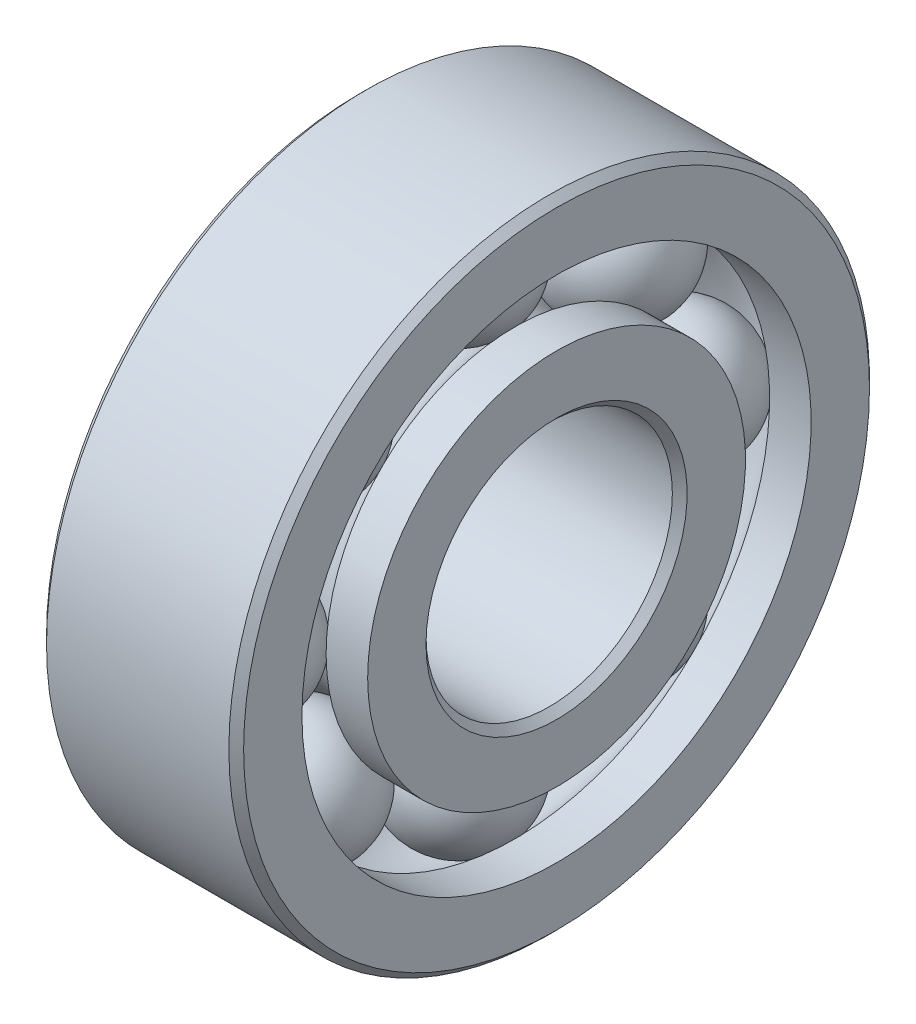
ISO-10303-21;
HEADER;
FILE_DESCRIPTION(('STEP AP214'),'2;1');
FILE_NAME('part.step','',(''),(''),'','','');
FILE_SCHEMA(('AUTOMOTIVE_DESIGN { 1 0 10303 214 1 1 1 1 }'));
ENDSEC;
DATA;
#1=APPLICATION_CONTEXT('core data for automotive mechanical design processes');
#2=APPLICATION_PROTOCOL_DEFINITION('international standard','automotive_design',2000,#1);
#3=PRODUCT_CONTEXT('',#1,'mechanical');
#4=PRODUCT('Part','Part','',(#3));
#5=PRODUCT_RELATED_PRODUCT_CATEGORY('part','',(#4));
#6=PRODUCT_DEFINITION_FORMATION('','',#4);
#7=PRODUCT_DEFINITION_CONTEXT('part definition',#1,'design');
#8=PRODUCT_DEFINITION('design','',#6,#7);
#9=PRODUCT_DEFINITION_SHAPE('','',#8);
#10=(LENGTH_UNIT() NAMED_UNIT(*) SI_UNIT(.MILLI.,.METRE.));
#11=(NAMED_UNIT(*) PLANE_ANGLE_UNIT() SI_UNIT($,.RADIAN.));
#12=(NAMED_UNIT(*) SI_UNIT($,.STERADIAN.) SOLID_ANGLE_UNIT());
#13=UNCERTAINTY_MEASURE_WITH_UNIT(LENGTH_MEASURE(1.E-05),#10,'distance_accuracy_value','');
#14=(GEOMETRIC_REPRESENTATION_CONTEXT(3) GLOBAL_UNCERTAINTY_ASSIGNED_CONTEXT((#13)) GLOBAL_UNIT_ASSIGNED_CONTEXT((#10,
#11,#12)) REPRESENTATION_CONTEXT('',''));
#15=CARTESIAN_POINT('',(0.,0.,0.));
#16=DIRECTION('',(0.,0.,1.));
#17=DIRECTION('',(1.,0.,0.));
#18=AXIS2_PLACEMENT_3D('',#15,#16,#17);
#19=CARTESIAN_POINT('',(0.,6.363961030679,-6.36396103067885));
#20=DIRECTION('',(-1.,0.,0.));
#21=DIRECTION('',(0.,0.707106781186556,-0.707106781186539));
#22=AXIS2_PLACEMENT_3D('',#19,#20,#21);
#23=SPHERICAL_SURFACE('',#22,2.67);
#24=CARTESIAN_POINT('',(-2.67,6.363961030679,-6.36396103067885));
#25=VERTEX_POINT('',#24);
#26=VERTEX_LOOP('',#25);
#27=FACE_BOUND('',#26,.T.);
#28=ADVANCED_FACE('F42',(#27),#23,.T.);
#29=CLOSED_SHELL('',(#28));
#30=MANIFOLD_SOLID_BREP('B2',#29);
#31=CARTESIAN_POINT('',(0.,0.,-9.));
#32=DIRECTION('',(-1.,0.,0.));
#33=DIRECTION('',(0.,0.,-1.));
#34=AXIS2_PLACEMENT_3D('',#31,#32,#33);
#35=SPHERICAL_SURFACE('',#34,2.67);
#36=CARTESIAN_POINT('',(-2.67,0.,-9.));
#37=VERTEX_POINT('',#36);
#38=VERTEX_LOOP('',#37);
#39=FACE_BOUND('',#38,.T.);
#40=ADVANCED_FACE('F63',(#39),#35,.T.);
#41=CLOSED_SHELL('',(#40));
#42=MANIFOLD_SOLID_BREP('B7',#41);
#43=CARTESIAN_POINT('',(0.,-6.36396103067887,-6.36396103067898));
#44=DIRECTION('',(-1.,0.,0.));
#45=DIRECTION('',(0.,-0.707106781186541,-0.707106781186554));
#46=AXIS2_PLACEMENT_3D('',#43,#44,#45);
#47=SPHERICAL_SURFACE('',#46,2.67);
#48=CARTESIAN_POINT('',(-2.67,-6.36396103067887,-6.36396103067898));
#49=VERTEX_POINT('',#48);
#50=VERTEX_LOOP('',#49);
#51=FACE_BOUND('',#50,.T.);
#52=ADVANCED_FACE('F81',(#51),#47,.T.);
#53=CLOSED_SHELL('',(#52));
#54=MANIFOLD_SOLID_BREP('B38',#53);
#55=CARTESIAN_POINT('',(0.,-9.,0.));
#56=DIRECTION('',(-1.,0.,0.));
#57=DIRECTION('',(0.,-1.,0.));
#58=AXIS2_PLACEMENT_3D('',#55,#56,#57);
#59=SPHERICAL_SURFACE('',#58,2.67);
#60=CARTESIAN_POINT('',(-2.67,-9.,0.));
#61=VERTEX_POINT('',#60);
#62=VERTEX_LOOP('',#61);
#63=FACE_BOUND('',#62,.T.);
#64=ADVANCED_FACE('F99',(#63),#59,.T.);
#65=CLOSED_SHELL('',(#64));
#66=MANIFOLD_SOLID_BREP('B59',#65);
#67=CARTESIAN_POINT('',(0.,-6.36396103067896,6.36396103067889));
#68=DIRECTION('',(-1.,0.,0.));
#69=DIRECTION('',(0.,-0.707106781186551,0.707106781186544));
#70=AXIS2_PLACEMENT_3D('',#67,#68,#69);
#71=SPHERICAL_SURFACE('',#70,2.67);
#72=CARTESIAN_POINT('',(-2.67,-6.36396103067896,6.36396103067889));
#73=VERTEX_POINT('',#72);
#74=VERTEX_LOOP('',#73);
#75=FACE_BOUND('',#74,.T.);
#76=ADVANCED_FACE('F117',(#75),#71,.T.);
#77=CLOSED_SHELL('',(#76));
#78=MANIFOLD_SOLID_BREP('B77',#77);
#79=CARTESIAN_POINT('',(0.,0.,9.));
#80=DIRECTION('',(-1.,0.,0.));
#81=DIRECTION('',(0.,0.,1.));
#82=AXIS2_PLACEMENT_3D('',#79,#80,#81);
#83=SPHERICAL_SURFACE('',#82,2.67);
#84=CARTESIAN_POINT('',(-2.67,0.,9.));
#85=VERTEX_POINT('',#84);
#86=VERTEX_LOOP('',#85);
#87=FACE_BOUND('',#86,.T.);
#88=ADVANCED_FACE('F135',(#87),#83,.T.);
#89=CLOSED_SHELL('',(#88));
#90=MANIFOLD_SOLID_BREP('B95',#89);
#91=CARTESIAN_POINT('',(0.,6.36396103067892,6.36396103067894));
#92=DIRECTION('',(-1.,0.,0.));
#93=DIRECTION('',(0.,0.707106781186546,0.707106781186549));
#94=AXIS2_PLACEMENT_3D('',#91,#92,#93);
#95=SPHERICAL_SURFACE('',#94,2.67);
#96=CARTESIAN_POINT('',(-2.67,6.36396103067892,6.36396103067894));
#97=VERTEX_POINT('',#96);
#98=VERTEX_LOOP('',#97);
#99=FACE_BOUND('',#98,.T.);
#100=ADVANCED_FACE('F153',(#99),#95,.T.);
#101=CLOSED_SHELL('',(#100));
#102=MANIFOLD_SOLID_BREP('B113',#101);
#103=CARTESIAN_POINT('',(0.,9.,0.));
#104=DIRECTION('',(-1.,0.,0.));
#105=DIRECTION('',(0.,1.,0.));
#106=AXIS2_PLACEMENT_3D('',#103,#104,#105);
#107=SPHERICAL_SURFACE('',#106,2.67);
#108=CARTESIAN_POINT('',(-2.67,9.,0.));
#109=VERTEX_POINT('',#108);
#110=VERTEX_LOOP('',#109);
#111=FACE_BOUND('',#110,.T.);
#112=ADVANCED_FACE('F173',(#111),#107,.T.);
#113=CLOSED_SHELL('',(#112));
#114=MANIFOLD_SOLID_BREP('B131',#113);
#115=CARTESIAN_POINT('',(-4.,10.3333333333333,0.));
#116=DIRECTION('',(1.,0.,0.));
#117=DIRECTION('',(0.,0.,-1.));
#118=AXIS2_PLACEMENT_3D('',#115,#116,#117);
#119=PLANE('',#118);
#120=CARTESIAN_POINT('',(-4.,0.,0.));
#121=DIRECTION('',(1.,0.,0.));
#122=DIRECTION('',(0.,0.,-1.));
#123=AXIS2_PLACEMENT_3D('',#120,#121,#122);
#124=CIRCLE('',#123,12.7);
#125=CARTESIAN_POINT('',(-4.,0.,-12.7));
#126=VERTEX_POINT('',#125);
#127=EDGE_CURVE('E172',#126,#126,#124,.F.);
#128=ORIENTED_EDGE('',*,*,#127,.T.);
#129=EDGE_LOOP('',(#128));
#130=FACE_BOUND('',#129,.T.);
#131=CARTESIAN_POINT('',(-4.,0.,0.));
#132=DIRECTION('',(-1.,0.,0.));
#133=DIRECTION('',(0.,0.,1.));
#134=AXIS2_PLACEMENT_3D('',#131,#132,#133);
#135=CIRCLE('',#134,10.3333333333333);
#136=CARTESIAN_POINT('',(-4.,0.,10.3333333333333));
#137=VERTEX_POINT('',#136);
#138=EDGE_CURVE('E212',#137,#137,#135,.T.);
#139=ORIENTED_EDGE('',*,*,#138,.F.);
#140=EDGE_LOOP('',(#139));
#141=FACE_BOUND('',#140,.T.);
#142=ADVANCED_FACE('F192',(#130,#141),#119,.F.);
#143=CARTESIAN_POINT('',(-4.,0.,0.));
#144=DIRECTION('',(-1.,0.,0.));
#145=DIRECTION('',(0.,0.,1.));
#146=AXIS2_PLACEMENT_3D('',#143,#144,#145);
#147=CYLINDRICAL_SURFACE('',#146,10.3333333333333);
#148=CARTESIAN_POINT('',(-2.31324927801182,0.,0.));
#149=DIRECTION('',(-1.,0.,0.));
#150=DIRECTION('',(0.,0.,1.));
#151=AXIS2_PLACEMENT_3D('',#148,#149,#150);
#152=CIRCLE('',#151,10.3333333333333);
#153=CARTESIAN_POINT('',(-2.31324927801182,0.,10.3333333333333));
#154=VERTEX_POINT('',#153);
#155=EDGE_CURVE('E215',#154,#154,#152,.T.);
#156=ORIENTED_EDGE('',*,*,#155,.F.);
#157=EDGE_LOOP('',(#156));
#158=FACE_BOUND('',#157,.T.);
#159=ORIENTED_EDGE('',*,*,#138,.T.);
#160=EDGE_LOOP('',(#159));
#161=FACE_BOUND('',#160,.T.);
#162=ADVANCED_FACE('F236',(#158,#161),#147,.F.);
#163=CARTESIAN_POINT('',(0.,0.,0.));
#164=DIRECTION('',(-1.,0.,0.));
#165=DIRECTION('',(0.,0.,1.));
#166=AXIS2_PLACEMENT_3D('',#163,#164,#165);
#167=TOROIDAL_SURFACE('',#166,9.,2.67);
#168=CARTESIAN_POINT('',(2.31324927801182,0.,0.));
#169=DIRECTION('',(-1.,0.,0.));
#170=DIRECTION('',(0.,0.,1.));
#171=AXIS2_PLACEMENT_3D('',#168,#169,#170);
#172=CIRCLE('',#171,10.3333333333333);
#173=CARTESIAN_POINT('',(2.31324927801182,0.,10.3333333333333));
#174=VERTEX_POINT('',#173);
#175=EDGE_CURVE('E218',#174,#174,#172,.T.);
#176=ORIENTED_EDGE('',*,*,#175,.F.);
#177=EDGE_LOOP('',(#176));
#178=FACE_BOUND('',#177,.T.);
#179=ORIENTED_EDGE('',*,*,#155,.T.);
#180=EDGE_LOOP('',(#179));
#181=FACE_BOUND('',#180,.T.);
#182=ADVANCED_FACE('F230',(#178,#181),#167,.F.);
#183=CARTESIAN_POINT('',(-4.,0.,0.));
#184=DIRECTION('',(-1.,0.,0.));
#185=DIRECTION('',(0.,0.,1.));
#186=AXIS2_PLACEMENT_3D('',#183,#184,#185);
#187=CYLINDRICAL_SURFACE('',#186,10.3333333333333);
#188=CARTESIAN_POINT('',(4.,0.,0.));
#189=DIRECTION('',(-1.,0.,0.));
#190=DIRECTION('',(0.,0.,1.));
#191=AXIS2_PLACEMENT_3D('',#188,#189,#190);
#192=CIRCLE('',#191,10.3333333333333);
#193=CARTESIAN_POINT('',(4.,0.,10.3333333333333));
#194=VERTEX_POINT('',#193);
#195=EDGE_CURVE('E221',#194,#194,#192,.T.);
#196=ORIENTED_EDGE('',*,*,#195,.F.);
#197=EDGE_LOOP('',(#196));
#198=FACE_BOUND('',#197,.T.);
#199=ORIENTED_EDGE('',*,*,#175,.T.);
#200=EDGE_LOOP('',(#199));
#201=FACE_BOUND('',#200,.T.);
#202=ADVANCED_FACE('F227',(#198,#201),#187,.F.);
#203=CARTESIAN_POINT('',(4.,10.3333333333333,0.));
#204=DIRECTION('',(-1.,0.,0.));
#205=DIRECTION('',(0.,0.,1.));
#206=AXIS2_PLACEMENT_3D('',#203,#204,#205);
#207=PLANE('',#206);
#208=CARTESIAN_POINT('',(4.,0.,0.));
#209=DIRECTION('',(-1.,0.,0.));
#210=DIRECTION('',(0.,0.,1.));
#211=AXIS2_PLACEMENT_3D('',#208,#209,#210);
#212=CIRCLE('',#211,12.7);
#213=CARTESIAN_POINT('',(4.,0.,12.7));
#214=VERTEX_POINT('',#213);
#215=EDGE_CURVE('E199',#214,#214,#212,.F.);
#216=ORIENTED_EDGE('',*,*,#215,.T.);
#217=EDGE_LOOP('',(#216));
#218=FACE_BOUND('',#217,.T.);
#219=ORIENTED_EDGE('',*,*,#195,.T.);
#220=EDGE_LOOP('',(#219));
#221=FACE_BOUND('',#220,.T.);
#222=ADVANCED_FACE('F225',(#218,#221),#207,.F.);
#223=CARTESIAN_POINT('',(-4.,0.,0.));
#224=DIRECTION('',(-1.,0.,0.));
#225=DIRECTION('',(0.,0.,1.));
#226=AXIS2_PLACEMENT_3D('',#223,#224,#225);
#227=CYLINDRICAL_SURFACE('',#226,13.);
#228=CARTESIAN_POINT('',(3.7,0.,0.));
#229=DIRECTION('',(-1.,0.,0.));
#230=DIRECTION('',(0.,0.,1.));
#231=AXIS2_PLACEMENT_3D('',#228,#229,#230);
#232=CIRCLE('',#231,13.);
#233=CARTESIAN_POINT('',(3.7,0.,13.));
#234=VERTEX_POINT('',#233);
#235=EDGE_CURVE('E203',#234,#234,#232,.T.);
#236=ORIENTED_EDGE('',*,*,#235,.T.);
#237=EDGE_LOOP('',(#236));
#238=FACE_BOUND('',#237,.T.);
#239=CARTESIAN_POINT('',(-3.7,0.,0.));
#240=DIRECTION('',(1.,0.,0.));
#241=DIRECTION('',(0.,0.,-1.));
#242=AXIS2_PLACEMENT_3D('',#239,#240,#241);
#243=CIRCLE('',#242,13.);
#244=CARTESIAN_POINT('',(-3.7,0.,-13.));
#245=VERTEX_POINT('',#244);
#246=EDGE_CURVE('E207',#245,#245,#243,.T.);
#247=ORIENTED_EDGE('',*,*,#246,.T.);
#248=EDGE_LOOP('',(#247));
#249=FACE_BOUND('',#248,.T.);
#250=ADVANCED_FACE('F251',(#238,#249),#227,.T.);
#251=CARTESIAN_POINT('',(3.7,0.,0.));
#252=DIRECTION('',(-1.,0.,0.));
#253=DIRECTION('',(0.,0.,1.));
#254=AXIS2_PLACEMENT_3D('',#251,#252,#253);
#255=CONICAL_SURFACE('',#254,13.,0.785398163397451);
#256=ORIENTED_EDGE('',*,*,#215,.F.);
#257=EDGE_LOOP('',(#256));
#258=FACE_BOUND('',#257,.T.);
#259=ORIENTED_EDGE('',*,*,#235,.F.);
#260=EDGE_LOOP('',(#259));
#261=FACE_BOUND('',#260,.T.);
#262=ADVANCED_FACE('F249',(#258,#261),#255,.T.);
#263=CARTESIAN_POINT('',(-4.,0.,0.));
#264=DIRECTION('',(1.,0.,0.));
#265=DIRECTION('',(0.,0.,-1.));
#266=AXIS2_PLACEMENT_3D('',#263,#264,#265);
#267=CONICAL_SURFACE('',#266,12.7,0.785398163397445);
#268=ORIENTED_EDGE('',*,*,#246,.F.);
#269=EDGE_LOOP('',(#268));
#270=FACE_BOUND('',#269,.T.);
#271=ORIENTED_EDGE('',*,*,#127,.F.);
#272=EDGE_LOOP('',(#271));
#273=FACE_BOUND('',#272,.T.);
#274=ADVANCED_FACE('F194',(#270,#273),#267,.T.);
#275=CLOSED_SHELL('',(#142,#162,#182,#202,#222,#250,#262,#274));
#276=MANIFOLD_SOLID_BREP('B149',#275);
#277=CARTESIAN_POINT('',(-4.,5.,0.));
#278=DIRECTION('',(1.,0.,0.));
#279=DIRECTION('',(0.,0.,-1.));
#280=AXIS2_PLACEMENT_3D('',#277,#278,#279);
#281=PLANE('',#280);
#282=CARTESIAN_POINT('',(-4.,0.,0.));
#283=DIRECTION('',(1.,0.,0.));
#284=DIRECTION('',(0.,0.,-1.));
#285=AXIS2_PLACEMENT_3D('',#282,#283,#284);
#286=CIRCLE('',#285,5.3);
#287=CARTESIAN_POINT('',(-4.,0.,-5.3));
#288=VERTEX_POINT('',#287);
#289=EDGE_CURVE('E191',#288,#288,#286,.T.);
#290=ORIENTED_EDGE('',*,*,#289,.T.);
#291=EDGE_LOOP('',(#290));
#292=FACE_BOUND('',#291,.T.);
#293=CARTESIAN_POINT('',(-4.,0.,0.));
#294=DIRECTION('',(-1.,0.,0.));
#295=DIRECTION('',(0.,0.,1.));
#296=AXIS2_PLACEMENT_3D('',#293,#294,#295);
#297=CIRCLE('',#296,7.66666666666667);
#298=CARTESIAN_POINT('',(-4.,0.,7.66666666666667));
#299=VERTEX_POINT('',#298);
#300=EDGE_CURVE('E342',#299,#299,#297,.T.);
#301=ORIENTED_EDGE('',*,*,#300,.T.);
#302=EDGE_LOOP('',(#301));
#303=FACE_BOUND('',#302,.T.);
#304=ADVANCED_FACE('F313',(#292,#303),#281,.F.);
#305=CARTESIAN_POINT('',(-4.,0.,0.));
#306=DIRECTION('',(-1.,0.,0.));
#307=DIRECTION('',(0.,0.,1.));
#308=AXIS2_PLACEMENT_3D('',#305,#306,#307);
#309=CYLINDRICAL_SURFACE('',#308,5.);
#310=CARTESIAN_POINT('',(3.7,0.,0.));
#311=DIRECTION('',(-1.,0.,0.));
#312=DIRECTION('',(0.,0.,1.));
#313=AXIS2_PLACEMENT_3D('',#310,#311,#312);
#314=CIRCLE('',#313,5.);
#315=CARTESIAN_POINT('',(3.7,0.,5.));
#316=VERTEX_POINT('',#315);
#317=EDGE_CURVE('E320',#316,#316,#314,.F.);
#318=ORIENTED_EDGE('',*,*,#317,.T.);
#319=EDGE_LOOP('',(#318));
#320=FACE_BOUND('',#319,.T.);
#321=CARTESIAN_POINT('',(-3.7,0.,0.));
#322=DIRECTION('',(1.,0.,0.));
#323=DIRECTION('',(0.,0.,-1.));
#324=AXIS2_PLACEMENT_3D('',#321,#322,#323);
#325=CIRCLE('',#324,5.);
#326=CARTESIAN_POINT('',(-3.7,0.,-5.));
#327=VERTEX_POINT('',#326);
#328=EDGE_CURVE('E324',#327,#327,#325,.F.);
#329=ORIENTED_EDGE('',*,*,#328,.T.);
#330=EDGE_LOOP('',(#329));
#331=FACE_BOUND('',#330,.T.);
#332=ADVANCED_FACE('F368',(#320,#331),#309,.F.);
#333=CARTESIAN_POINT('',(4.,5.,0.));
#334=DIRECTION('',(-1.,0.,0.));
#335=DIRECTION('',(0.,0.,1.));
#336=AXIS2_PLACEMENT_3D('',#333,#334,#335);
#337=PLANE('',#336);
#338=CARTESIAN_POINT('',(4.,0.,0.));
#339=DIRECTION('',(-1.,0.,0.));
#340=DIRECTION('',(0.,0.,1.));
#341=AXIS2_PLACEMENT_3D('',#338,#339,#340);
#342=CIRCLE('',#341,5.3);
#343=CARTESIAN_POINT('',(4.,0.,5.3));
#344=VERTEX_POINT('',#343);
#345=EDGE_CURVE('E328',#344,#344,#342,.T.);
#346=ORIENTED_EDGE('',*,*,#345,.T.);
#347=EDGE_LOOP('',(#346));
#348=FACE_BOUND('',#347,.T.);
#349=CARTESIAN_POINT('',(4.,0.,0.));
#350=DIRECTION('',(-1.,0.,0.));
#351=DIRECTION('',(0.,0.,1.));
#352=AXIS2_PLACEMENT_3D('',#349,#350,#351);
#353=CIRCLE('',#352,7.66666666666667);
#354=CARTESIAN_POINT('',(4.,0.,7.66666666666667));
#355=VERTEX_POINT('',#354);
#356=EDGE_CURVE('E333',#355,#355,#353,.T.);
#357=ORIENTED_EDGE('',*,*,#356,.F.);
#358=EDGE_LOOP('',(#357));
#359=FACE_BOUND('',#358,.T.);
#360=ADVANCED_FACE('F363',(#348,#359),#337,.F.);
#361=CARTESIAN_POINT('',(-4.,0.,0.));
#362=DIRECTION('',(-1.,0.,0.));
#363=DIRECTION('',(0.,0.,1.));
#364=AXIS2_PLACEMENT_3D('',#361,#362,#363);
#365=CYLINDRICAL_SURFACE('',#364,7.66666666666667);
#366=CARTESIAN_POINT('',(2.31324927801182,0.,0.));
#367=DIRECTION('',(-1.,0.,0.));
#368=DIRECTION('',(0.,0.,1.));
#369=AXIS2_PLACEMENT_3D('',#366,#367,#368);
#370=CIRCLE('',#369,7.66666666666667);
#371=CARTESIAN_POINT('',(2.31324927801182,0.,7.66666666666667));
#372=VERTEX_POINT('',#371);
#373=EDGE_CURVE('E336',#372,#372,#370,.T.);
#374=ORIENTED_EDGE('',*,*,#373,.F.);
#375=EDGE_LOOP('',(#374));
#376=FACE_BOUND('',#375,.T.);
#377=ORIENTED_EDGE('',*,*,#356,.T.);
#378=EDGE_LOOP('',(#377));
#379=FACE_BOUND('',#378,.T.);
#380=ADVANCED_FACE('F357',(#376,#379),#365,.T.);
#381=CARTESIAN_POINT('',(0.,0.,0.));
#382=DIRECTION('',(-1.,0.,0.));
#383=DIRECTION('',(0.,0.,1.));
#384=AXIS2_PLACEMENT_3D('',#381,#382,#383);
#385=TOROIDAL_SURFACE('',#384,9.,2.67);
#386=CARTESIAN_POINT('',(-2.31324927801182,0.,0.));
#387=DIRECTION('',(-1.,0.,0.));
#388=DIRECTION('',(0.,0.,1.));
#389=AXIS2_PLACEMENT_3D('',#386,#387,#388);
#390=CIRCLE('',#389,7.66666666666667);
#391=CARTESIAN_POINT('',(-2.31324927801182,0.,7.66666666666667));
#392=VERTEX_POINT('',#391);
#393=EDGE_CURVE('E339',#392,#392,#390,.T.);
#394=ORIENTED_EDGE('',*,*,#393,.F.);
#395=EDGE_LOOP('',(#394));
#396=FACE_BOUND('',#395,.T.);
#397=ORIENTED_EDGE('',*,*,#373,.T.);
#398=EDGE_LOOP('',(#397));
#399=FACE_BOUND('',#398,.T.);
#400=ADVANCED_FACE('F351',(#396,#399),#385,.F.);
#401=CARTESIAN_POINT('',(-4.,0.,0.));
#402=DIRECTION('',(-1.,0.,0.));
#403=DIRECTION('',(0.,0.,1.));
#404=AXIS2_PLACEMENT_3D('',#401,#402,#403);
#405=CYLINDRICAL_SURFACE('',#404,7.66666666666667);
#406=ORIENTED_EDGE('',*,*,#300,.F.);
#407=EDGE_LOOP('',(#406));
#408=FACE_BOUND('',#407,.T.);
#409=ORIENTED_EDGE('',*,*,#393,.T.);
#410=EDGE_LOOP('',(#409));
#411=FACE_BOUND('',#410,.T.);
#412=ADVANCED_FACE('F347',(#408,#411),#405,.T.);
#413=CARTESIAN_POINT('',(4.,0.,0.));
#414=DIRECTION('',(1.,0.,0.));
#415=DIRECTION('',(0.,0.,-1.));
#416=AXIS2_PLACEMENT_3D('',#413,#414,#415);
#417=CONICAL_SURFACE('',#416,5.3,0.785398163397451);
#418=ORIENTED_EDGE('',*,*,#317,.F.);
#419=EDGE_LOOP('',(#418));
#420=FACE_BOUND('',#419,.T.);
#421=ORIENTED_EDGE('',*,*,#345,.F.);
#422=EDGE_LOOP('',(#421));
#423=FACE_BOUND('',#422,.T.);
#424=ADVANCED_FACE('F350',(#420,#423),#417,.F.);
#425=CARTESIAN_POINT('',(-3.7,0.,0.));
#426=DIRECTION('',(-1.,0.,0.));
#427=DIRECTION('',(0.,0.,1.));
#428=AXIS2_PLACEMENT_3D('',#425,#426,#427);
#429=CONICAL_SURFACE('',#428,5.,0.785398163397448);
#430=ORIENTED_EDGE('',*,*,#289,.F.);
#431=EDGE_LOOP('',(#430));
#432=FACE_BOUND('',#431,.T.);
#433=ORIENTED_EDGE('',*,*,#328,.F.);
#434=EDGE_LOOP('',(#433));
#435=FACE_BOUND('',#434,.T.);
#436=ADVANCED_FACE('F315',(#432,#435),#429,.F.);
#437=CLOSED_SHELL('',(#304,#332,#360,#380,#400,#412,#424,#436));
#438=MANIFOLD_SOLID_BREP('B167',#437);
#439=ADVANCED_BREP_SHAPE_REPRESENTATION('',(#18,#30,#42,#54,#66,#78,#90,#102,#114,#276,#438),#14);
#440=SHAPE_DEFINITION_REPRESENTATION(#9,#439);
ENDSEC;
END-ISO-10303-21;
